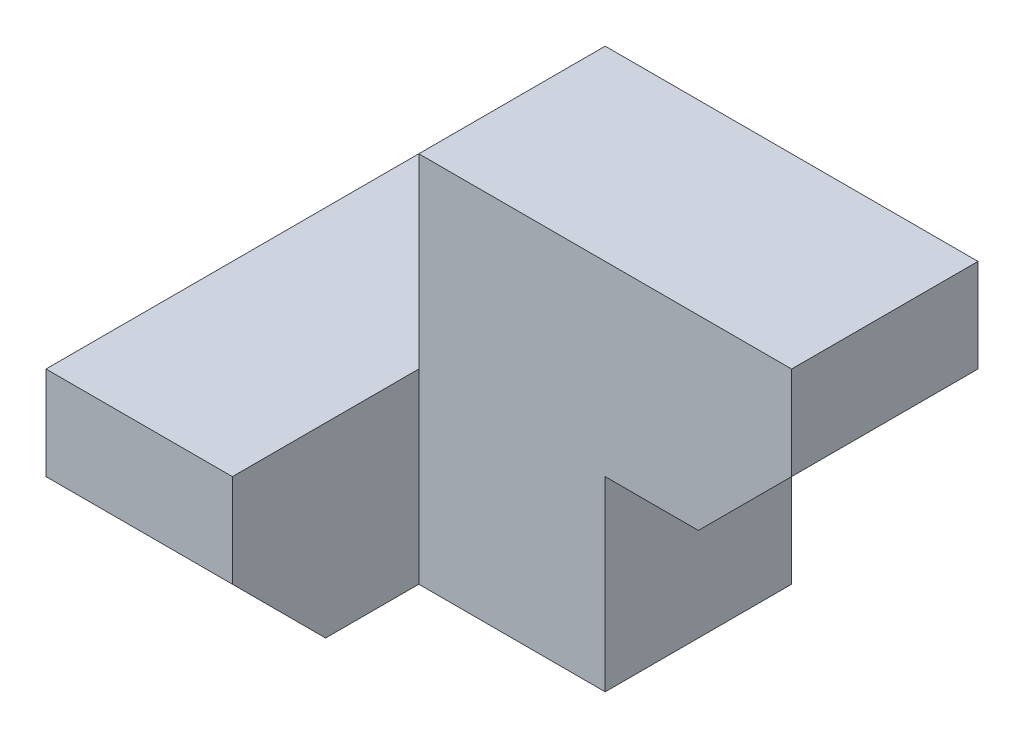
from build123d import *

# Parameters (mm, degrees)
BOSS_EXTRU_1_DEPTH = 10
ESQUISSE2_W        = 10
ESQUISSE2_H        = 10
BOSS_EXTRU_2_DEPTH = 10
CHANFREIN1_SIZE    = 5


with BuildPart() as part:
    # Esquisse1 → Boss.-Extru.1 (new body)
    with BuildSketch(Plane.XY):
        Polygon((0, 0), (20, 0), (20, 10), (30, 10), (30, 20), (10, 20), (10, 10), (0, 10), align=None)
    extrude(amount=BOSS_EXTRU_1_DEPTH)

    # Esquisse2 → Boss.-Extru.2 (add)
    with BuildSketch(Plane.XY.offset(10)):
        with Locations((5, 5)):
            Rectangle(ESQUISSE2_W, ESQUISSE2_H)
    extrude(amount=BOSS_EXTRU_2_DEPTH)

    # Chanfrein1
    chanfrein1_edges = [part.edges().sort_by_distance(p)[0] for p in [
        (30, 10, 5),
        (5, 0, 20),
    ]]
    chamfer(chanfrein1_edges, length=CHANFREIN1_SIZE)


solid = part.part
